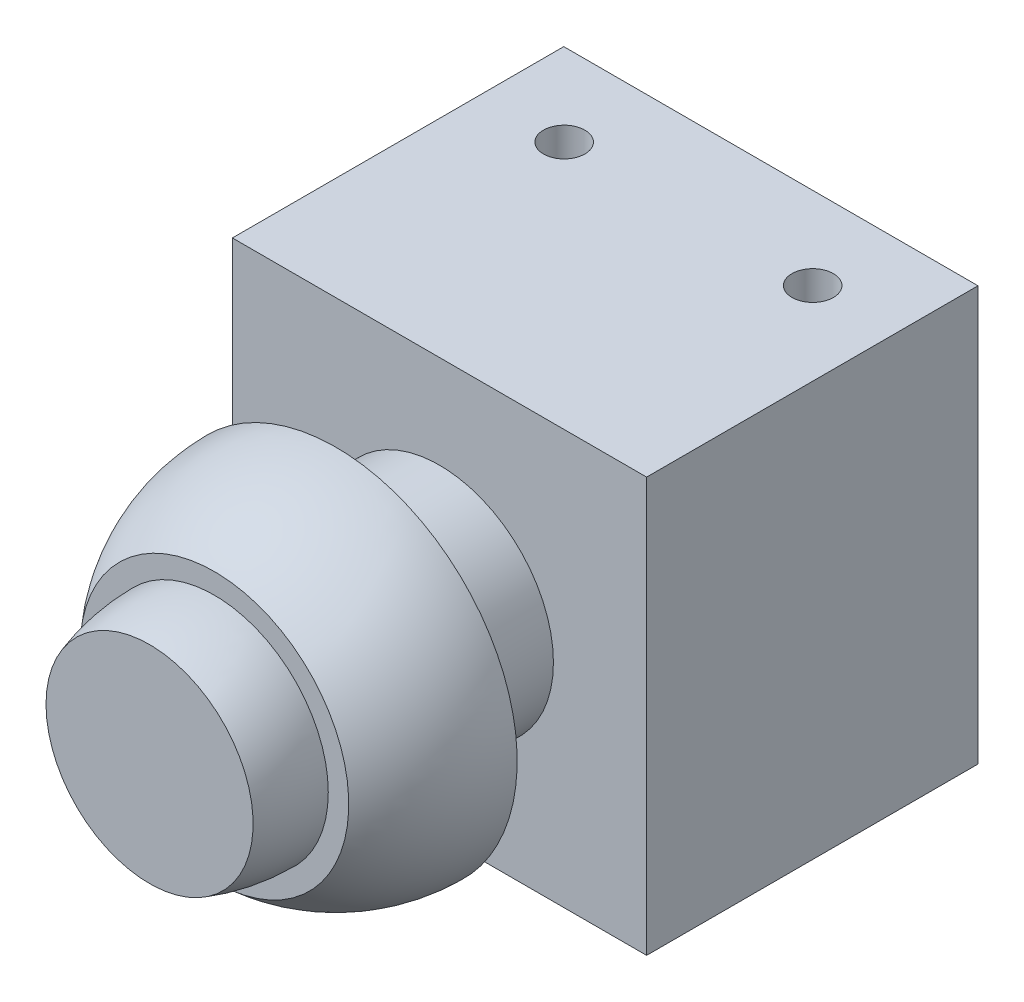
ISO-10303-21;
HEADER;
FILE_DESCRIPTION(('STEP AP214'),'2;1');
FILE_NAME('part.step','',(''),(''),'','','');
FILE_SCHEMA(('AUTOMOTIVE_DESIGN { 1 0 10303 214 1 1 1 1 }'));
ENDSEC;
DATA;
#1=APPLICATION_CONTEXT('core data for automotive mechanical design processes');
#2=APPLICATION_PROTOCOL_DEFINITION('international standard','automotive_design',2000,#1);
#3=PRODUCT_CONTEXT('',#1,'mechanical');
#4=PRODUCT('Part','Part','',(#3));
#5=PRODUCT_RELATED_PRODUCT_CATEGORY('part','',(#4));
#6=PRODUCT_DEFINITION_FORMATION('','',#4);
#7=PRODUCT_DEFINITION_CONTEXT('part definition',#1,'design');
#8=PRODUCT_DEFINITION('design','',#6,#7);
#9=PRODUCT_DEFINITION_SHAPE('','',#8);
#10=(LENGTH_UNIT() NAMED_UNIT(*) SI_UNIT(.MILLI.,.METRE.));
#11=(NAMED_UNIT(*) PLANE_ANGLE_UNIT() SI_UNIT($,.RADIAN.));
#12=(NAMED_UNIT(*) SI_UNIT($,.STERADIAN.) SOLID_ANGLE_UNIT());
#13=UNCERTAINTY_MEASURE_WITH_UNIT(LENGTH_MEASURE(1.E-05),#10,'distance_accuracy_value','');
#14=(GEOMETRIC_REPRESENTATION_CONTEXT(3) GLOBAL_UNCERTAINTY_ASSIGNED_CONTEXT((#13)) GLOBAL_UNIT_ASSIGNED_CONTEXT((#10,
#11,#12)) REPRESENTATION_CONTEXT('',''));
#15=CARTESIAN_POINT('',(0.,0.,0.));
#16=DIRECTION('',(0.,0.,1.));
#17=DIRECTION('',(1.,0.,0.));
#18=AXIS2_PLACEMENT_3D('',#15,#16,#17);
#19=CARTESIAN_POINT('',(20.,-20.,56.5685424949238));
#20=DIRECTION('',(0.,-1.,0.));
#21=DIRECTION('',(0.,0.,-1.));
#22=AXIS2_PLACEMENT_3D('',#19,#20,#21);
#23=PLANE('',#22);
#24=CARTESIAN_POINT('',(-12.,-20.,-34.036711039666));
#25=DIRECTION('',(0.,1.,0.));
#26=DIRECTION('',(0.,0.,1.));
#27=AXIS2_PLACEMENT_3D('',#24,#25,#26);
#28=CIRCLE('',#27,2.00000000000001);
#29=CARTESIAN_POINT('',(-12.,-20.,-32.036711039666));
#30=VERTEX_POINT('',#29);
#31=EDGE_CURVE('E350',#30,#30,#28,.T.);
#32=ORIENTED_EDGE('',*,*,#31,.T.);
#33=EDGE_LOOP('',(#32));
#34=FACE_BOUND('',#33,.T.);
#35=DIRECTION('',(1.,0.,0.));
#36=VECTOR('',#35,1.);
#37=CARTESIAN_POINT('',(20.,-20.,-9.99999999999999));
#38=LINE('',#37,#36);
#39=CARTESIAN_POINT('',(-20.,-20.,-9.99999999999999));
#40=VERTEX_POINT('',#39);
#41=CARTESIAN_POINT('',(20.,-20.,-9.99999999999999));
#42=VERTEX_POINT('',#41);
#43=EDGE_CURVE('E59',#40,#42,#38,.T.);
#44=ORIENTED_EDGE('',*,*,#43,.F.);
#45=DIRECTION('',(0.,0.,-1.));
#46=VECTOR('',#45,1.);
#47=CARTESIAN_POINT('',(-20.,-20.,56.5685424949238));
#48=LINE('',#47,#46);
#49=CARTESIAN_POINT('',(-20.,-20.,-42.));
#50=VERTEX_POINT('',#49);
#51=EDGE_CURVE('E88',#40,#50,#48,.T.);
#52=ORIENTED_EDGE('',*,*,#51,.T.);
#53=DIRECTION('',(-1.,0.,0.));
#54=VECTOR('',#53,1.);
#55=CARTESIAN_POINT('',(20.,-20.,-42.));
#56=LINE('',#55,#54);
#57=CARTESIAN_POINT('',(20.,-20.,-42.));
#58=VERTEX_POINT('',#57);
#59=EDGE_CURVE('E92',#58,#50,#56,.T.);
#60=ORIENTED_EDGE('',*,*,#59,.F.);
#61=DIRECTION('',(0.,0.,-1.));
#62=VECTOR('',#61,1.);
#63=CARTESIAN_POINT('',(20.,-20.,56.5685424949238));
#64=LINE('',#63,#62);
#65=EDGE_CURVE('E79',#42,#58,#64,.T.);
#66=ORIENTED_EDGE('',*,*,#65,.F.);
#67=EDGE_LOOP('',(#44,#52,#60,#66));
#68=FACE_BOUND('',#67,.T.);
#69=CARTESIAN_POINT('',(12.,-20.,-34.036711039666));
#70=DIRECTION('',(0.,1.,0.));
#71=DIRECTION('',(0.,0.,1.));
#72=AXIS2_PLACEMENT_3D('',#69,#70,#71);
#73=CIRCLE('',#72,2.00000000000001);
#74=CARTESIAN_POINT('',(12.,-20.,-32.036711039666));
#75=VERTEX_POINT('',#74);
#76=EDGE_CURVE('E351',#75,#75,#73,.T.);
#77=ORIENTED_EDGE('',*,*,#76,.T.);
#78=EDGE_LOOP('',(#77));
#79=FACE_BOUND('',#78,.T.);
#80=ADVANCED_FACE('F41',(#34,#68,#79),#23,.T.);
#81=CARTESIAN_POINT('',(0.,0.,0.));
#82=DIRECTION('',(0.,0.,-1.));
#83=DIRECTION('',(-1.,0.,0.));
#84=AXIS2_PLACEMENT_3D('',#81,#82,#83);
#85=CYLINDRICAL_SURFACE('',#84,11.);
#86=CARTESIAN_POINT('',(0.,0.,0.));
#87=DIRECTION('',(0.,0.,-1.));
#88=DIRECTION('',(-1.,0.,0.));
#89=AXIS2_PLACEMENT_3D('',#86,#87,#88);
#90=CIRCLE('',#89,11.);
#91=CARTESIAN_POINT('',(-11.,0.,0.));
#92=VERTEX_POINT('',#91);
#93=EDGE_CURVE('E13',#92,#92,#90,.T.);
#94=ORIENTED_EDGE('',*,*,#93,.T.);
#95=EDGE_LOOP('',(#94));
#96=FACE_BOUND('',#95,.T.);
#97=CARTESIAN_POINT('',(0.,0.,-10.));
#98=DIRECTION('',(0.,0.,-1.));
#99=DIRECTION('',(-1.,0.,0.));
#100=AXIS2_PLACEMENT_3D('',#97,#98,#99);
#101=CIRCLE('',#100,11.);
#102=CARTESIAN_POINT('',(-11.,0.,-10.));
#103=VERTEX_POINT('',#102);
#104=EDGE_CURVE('E45',#103,#103,#101,.F.);
#105=ORIENTED_EDGE('',*,*,#104,.T.);
#106=EDGE_LOOP('',(#105));
#107=FACE_BOUND('',#106,.T.);
#108=ADVANCED_FACE('F148',(#96,#107),#85,.T.);
#109=CARTESIAN_POINT('',(0.,10.,18.));
#110=DIRECTION('',(0.,0.,1.));
#111=DIRECTION('',(1.,0.,0.));
#112=AXIS2_PLACEMENT_3D('',#109,#110,#111);
#113=PLANE('',#112);
#114=CARTESIAN_POINT('',(0.,0.,18.));
#115=DIRECTION('',(0.,0.,-1.));
#116=DIRECTION('',(-1.,0.,0.));
#117=AXIS2_PLACEMENT_3D('',#114,#115,#116);
#118=CIRCLE('',#117,9.99999999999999);
#119=CARTESIAN_POINT('',(-9.99999999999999,0.,18.));
#120=VERTEX_POINT('',#119);
#121=EDGE_CURVE('E119',#120,#120,#118,.T.);
#122=ORIENTED_EDGE('',*,*,#121,.F.);
#123=EDGE_LOOP('',(#122));
#124=FACE_BOUND('',#123,.T.);
#125=ADVANCED_FACE('F43',(#124),#113,.T.);
#126=CARTESIAN_POINT('',(0.,11.,0.));
#127=DIRECTION('',(0.,0.,-1.));
#128=DIRECTION('',(-1.,0.,0.));
#129=AXIS2_PLACEMENT_3D('',#126,#127,#128);
#130=PLANE('',#129);
#131=CARTESIAN_POINT('',(0.,0.,0.));
#132=DIRECTION('',(0.,0.,-1.));
#133=DIRECTION('',(-1.,0.,0.));
#134=AXIS2_PLACEMENT_3D('',#131,#132,#133);
#135=CIRCLE('',#134,17.5);
#136=CARTESIAN_POINT('',(-17.5,0.,0.));
#137=VERTEX_POINT('',#136);
#138=EDGE_CURVE('E51',#137,#137,#135,.T.);
#139=ORIENTED_EDGE('',*,*,#138,.T.);
#140=EDGE_LOOP('',(#139));
#141=FACE_BOUND('',#140,.T.);
#142=ORIENTED_EDGE('',*,*,#93,.F.);
#143=EDGE_LOOP('',(#142));
#144=FACE_BOUND('',#143,.T.);
#145=ADVANCED_FACE('F131',(#141,#144),#130,.T.);
#146=CARTESIAN_POINT('',(0.,0.,0.));
#147=DIRECTION('',(0.,0.,-1.));
#148=DIRECTION('',(0.,1.,0.));
#149=AXIS2_PLACEMENT_3D('',#146,#147,#148);
#150=SPHERICAL_SURFACE('',#149,17.5);
#151=CARTESIAN_POINT('',(0.,0.,11.7410754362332));
#152=DIRECTION('',(0.,0.,-1.));
#153=DIRECTION('',(-1.,0.,0.));
#154=AXIS2_PLACEMENT_3D('',#151,#152,#153);
#155=CIRCLE('',#154,12.9767926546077);
#156=CARTESIAN_POINT('',(-12.9767926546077,0.,11.7410754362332));
#157=VERTEX_POINT('',#156);
#158=EDGE_CURVE('E125',#157,#157,#155,.T.);
#159=ORIENTED_EDGE('',*,*,#158,.T.);
#160=EDGE_LOOP('',(#159));
#161=FACE_BOUND('',#160,.T.);
#162=ORIENTED_EDGE('',*,*,#138,.F.);
#163=EDGE_LOOP('',(#162));
#164=FACE_BOUND('',#163,.T.);
#165=ADVANCED_FACE('F134',(#161,#164),#150,.T.);
#166=CARTESIAN_POINT('',(0.,12.9767926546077,11.7410754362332));
#167=DIRECTION('',(0.,0.,1.));
#168=DIRECTION('',(1.,0.,0.));
#169=AXIS2_PLACEMENT_3D('',#166,#167,#168);
#170=PLANE('',#169);
#171=CARTESIAN_POINT('',(0.,0.,11.7410754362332));
#172=DIRECTION('',(0.,0.,-1.));
#173=DIRECTION('',(-1.,0.,0.));
#174=AXIS2_PLACEMENT_3D('',#171,#172,#173);
#175=CIRCLE('',#174,11.);
#176=CARTESIAN_POINT('',(-11.,0.,11.7410754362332));
#177=VERTEX_POINT('',#176);
#178=EDGE_CURVE('E122',#177,#177,#175,.T.);
#179=ORIENTED_EDGE('',*,*,#178,.T.);
#180=EDGE_LOOP('',(#179));
#181=FACE_BOUND('',#180,.T.);
#182=ORIENTED_EDGE('',*,*,#158,.F.);
#183=EDGE_LOOP('',(#182));
#184=FACE_BOUND('',#183,.T.);
#185=ADVANCED_FACE('F136',(#181,#184),#170,.T.);
#186=CARTESIAN_POINT('',(0.,0.,11.7410754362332));
#187=DIRECTION('',(0.,0.,-1.));
#188=DIRECTION('',(-1.,0.,0.));
#189=AXIS2_PLACEMENT_3D('',#186,#187,#188);
#190=DEGENERATE_TOROIDAL_SURFACE('',#189,9.08706834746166,20.0870683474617,.F.);
#191=ORIENTED_EDGE('',*,*,#121,.T.);
#192=EDGE_LOOP('',(#191));
#193=FACE_BOUND('',#192,.T.);
#194=ORIENTED_EDGE('',*,*,#178,.F.);
#195=EDGE_LOOP('',(#194));
#196=FACE_BOUND('',#195,.T.);
#197=ADVANCED_FACE('F143',(#193,#196),#190,.F.);
#198=CARTESIAN_POINT('',(20.,20.,56.5685424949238));
#199=DIRECTION('',(1.,0.,0.));
#200=DIRECTION('',(0.,1.,0.));
#201=AXIS2_PLACEMENT_3D('',#198,#199,#200);
#202=PLANE('',#201);
#203=DIRECTION('',(0.,1.,0.));
#204=VECTOR('',#203,1.);
#205=CARTESIAN_POINT('',(20.,20.,-9.99999999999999));
#206=LINE('',#205,#204);
#207=CARTESIAN_POINT('',(20.,20.,-9.99999999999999));
#208=VERTEX_POINT('',#207);
#209=EDGE_CURVE('E86',#42,#208,#206,.T.);
#210=ORIENTED_EDGE('',*,*,#209,.F.);
#211=ORIENTED_EDGE('',*,*,#65,.T.);
#212=DIRECTION('',(0.,-1.,0.));
#213=VECTOR('',#212,1.);
#214=CARTESIAN_POINT('',(20.,20.,-42.));
#215=LINE('',#214,#213);
#216=CARTESIAN_POINT('',(20.,20.,-42.));
#217=VERTEX_POINT('',#216);
#218=EDGE_CURVE('E84',#217,#58,#215,.T.);
#219=ORIENTED_EDGE('',*,*,#218,.F.);
#220=DIRECTION('',(0.,0.,-1.));
#221=VECTOR('',#220,1.);
#222=CARTESIAN_POINT('',(20.,20.,56.5685424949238));
#223=LINE('',#222,#221);
#224=EDGE_CURVE('E112',#208,#217,#223,.T.);
#225=ORIENTED_EDGE('',*,*,#224,.F.);
#226=EDGE_LOOP('',(#210,#211,#219,#225));
#227=FACE_BOUND('',#226,.T.);
#228=ADVANCED_FACE('F81',(#227),#202,.T.);
#229=CARTESIAN_POINT('',(20.,20.,56.5685424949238));
#230=DIRECTION('',(0.,1.,0.));
#231=DIRECTION('',(0.,0.,1.));
#232=AXIS2_PLACEMENT_3D('',#229,#230,#231);
#233=PLANE('',#232);
#234=CARTESIAN_POINT('',(12.,20.,-34.036711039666));
#235=DIRECTION('',(0.,1.,0.));
#236=DIRECTION('',(0.,0.,1.));
#237=AXIS2_PLACEMENT_3D('',#234,#235,#236);
#238=CIRCLE('',#237,2.00000000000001);
#239=CARTESIAN_POINT('',(12.,20.,-32.036711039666));
#240=VERTEX_POINT('',#239);
#241=EDGE_CURVE('E359',#240,#240,#238,.T.);
#242=ORIENTED_EDGE('',*,*,#241,.F.);
#243=EDGE_LOOP('',(#242));
#244=FACE_BOUND('',#243,.T.);
#245=CARTESIAN_POINT('',(-12.,20.,-34.036711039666));
#246=DIRECTION('',(0.,1.,0.));
#247=DIRECTION('',(0.,0.,1.));
#248=AXIS2_PLACEMENT_3D('',#245,#246,#247);
#249=CIRCLE('',#248,2.00000000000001);
#250=CARTESIAN_POINT('',(-12.,20.,-32.036711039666));
#251=VERTEX_POINT('',#250);
#252=EDGE_CURVE('E105',#251,#251,#249,.T.);
#253=ORIENTED_EDGE('',*,*,#252,.F.);
#254=EDGE_LOOP('',(#253));
#255=FACE_BOUND('',#254,.T.);
#256=DIRECTION('',(-1.,0.,0.));
#257=VECTOR('',#256,1.);
#258=CARTESIAN_POINT('',(20.,20.,-9.99999999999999));
#259=LINE('',#258,#257);
#260=CARTESIAN_POINT('',(-20.,20.,-9.99999999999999));
#261=VERTEX_POINT('',#260);
#262=EDGE_CURVE('E368',#208,#261,#259,.T.);
#263=ORIENTED_EDGE('',*,*,#262,.F.);
#264=ORIENTED_EDGE('',*,*,#224,.T.);
#265=DIRECTION('',(1.,0.,0.));
#266=VECTOR('',#265,1.);
#267=CARTESIAN_POINT('',(20.,20.,-42.));
#268=LINE('',#267,#266);
#269=CARTESIAN_POINT('',(-20.,20.,-42.));
#270=VERTEX_POINT('',#269);
#271=EDGE_CURVE('E89',#270,#217,#268,.T.);
#272=ORIENTED_EDGE('',*,*,#271,.F.);
#273=DIRECTION('',(0.,0.,-1.));
#274=VECTOR('',#273,1.);
#275=CARTESIAN_POINT('',(-20.,20.,56.5685424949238));
#276=LINE('',#275,#274);
#277=EDGE_CURVE('E115',#261,#270,#276,.T.);
#278=ORIENTED_EDGE('',*,*,#277,.F.);
#279=EDGE_LOOP('',(#263,#264,#272,#278));
#280=FACE_BOUND('',#279,.T.);
#281=ADVANCED_FACE('F163',(#244,#255,#280),#233,.T.);
#282=CARTESIAN_POINT('',(-20.,20.,56.5685424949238));
#283=DIRECTION('',(-1.,0.,0.));
#284=DIRECTION('',(0.,0.,1.));
#285=AXIS2_PLACEMENT_3D('',#282,#283,#284);
#286=PLANE('',#285);
#287=DIRECTION('',(0.,-1.,0.));
#288=VECTOR('',#287,1.);
#289=CARTESIAN_POINT('',(-20.,20.,-9.99999999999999));
#290=LINE('',#289,#288);
#291=EDGE_CURVE('E114',#261,#40,#290,.T.);
#292=ORIENTED_EDGE('',*,*,#291,.F.);
#293=ORIENTED_EDGE('',*,*,#277,.T.);
#294=DIRECTION('',(0.,1.,0.));
#295=VECTOR('',#294,1.);
#296=CARTESIAN_POINT('',(-20.,20.,-42.));
#297=LINE('',#296,#295);
#298=EDGE_CURVE('E98',#50,#270,#297,.T.);
#299=ORIENTED_EDGE('',*,*,#298,.F.);
#300=ORIENTED_EDGE('',*,*,#51,.F.);
#301=EDGE_LOOP('',(#292,#293,#299,#300));
#302=FACE_BOUND('',#301,.T.);
#303=ADVANCED_FACE('F159',(#302),#286,.T.);
#304=CARTESIAN_POINT('',(0.,11.,-10.));
#305=DIRECTION('',(0.,0.,-1.));
#306=DIRECTION('',(-1.,0.,0.));
#307=AXIS2_PLACEMENT_3D('',#304,#305,#306);
#308=PLANE('',#307);
#309=ORIENTED_EDGE('',*,*,#104,.F.);
#310=EDGE_LOOP('',(#309));
#311=FACE_BOUND('',#310,.T.);
#312=ORIENTED_EDGE('',*,*,#209,.T.);
#313=ORIENTED_EDGE('',*,*,#262,.T.);
#314=ORIENTED_EDGE('',*,*,#291,.T.);
#315=ORIENTED_EDGE('',*,*,#43,.T.);
#316=EDGE_LOOP('',(#312,#313,#314,#315));
#317=FACE_BOUND('',#316,.T.);
#318=ADVANCED_FACE('F238',(#311,#317),#308,.F.);
#319=CARTESIAN_POINT('',(0.,11.,-42.));
#320=DIRECTION('',(0.,0.,1.));
#321=DIRECTION('',(1.,0.,0.));
#322=AXIS2_PLACEMENT_3D('',#319,#320,#321);
#323=PLANE('',#322);
#324=ORIENTED_EDGE('',*,*,#218,.T.);
#325=ORIENTED_EDGE('',*,*,#59,.T.);
#326=ORIENTED_EDGE('',*,*,#298,.T.);
#327=ORIENTED_EDGE('',*,*,#271,.T.);
#328=EDGE_LOOP('',(#324,#325,#326,#327));
#329=FACE_BOUND('',#328,.T.);
#330=ADVANCED_FACE('F100',(#329),#323,.F.);
#331=CARTESIAN_POINT('',(-12.,15.,-34.036711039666));
#332=DIRECTION('',(0.,1.,0.));
#333=DIRECTION('',(0.,0.,1.));
#334=AXIS2_PLACEMENT_3D('',#331,#332,#333);
#335=CYLINDRICAL_SURFACE('',#334,2.00000000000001);
#336=CARTESIAN_POINT('',(-12.,15.,-34.036711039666));
#337=DIRECTION('',(0.,1.,0.));
#338=DIRECTION('',(0.,0.,1.));
#339=AXIS2_PLACEMENT_3D('',#336,#337,#338);
#340=CIRCLE('',#339,2.00000000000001);
#341=CARTESIAN_POINT('',(-12.,15.,-32.036711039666));
#342=VERTEX_POINT('',#341);
#343=EDGE_CURVE('E102',#342,#342,#340,.T.);
#344=ORIENTED_EDGE('',*,*,#343,.F.);
#345=EDGE_LOOP('',(#344));
#346=FACE_BOUND('',#345,.T.);
#347=ORIENTED_EDGE('',*,*,#252,.T.);
#348=EDGE_LOOP('',(#347));
#349=FACE_BOUND('',#348,.T.);
#350=ADVANCED_FACE('F254',(#346,#349),#335,.F.);
#351=CARTESIAN_POINT('',(-12.,15.,-34.036711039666));
#352=DIRECTION('',(0.,1.,0.));
#353=DIRECTION('',(0.,0.,1.));
#354=AXIS2_PLACEMENT_3D('',#351,#352,#353);
#355=PLANE('',#354);
#356=ORIENTED_EDGE('',*,*,#343,.T.);
#357=EDGE_LOOP('',(#356));
#358=FACE_BOUND('',#357,.T.);
#359=ADVANCED_FACE('F263',(#358),#355,.T.);
#360=CARTESIAN_POINT('',(12.,15.,-34.036711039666));
#361=DIRECTION('',(0.,1.,0.));
#362=DIRECTION('',(0.,0.,1.));
#363=AXIS2_PLACEMENT_3D('',#360,#361,#362);
#364=CYLINDRICAL_SURFACE('',#363,2.00000000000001);
#365=CARTESIAN_POINT('',(12.,15.,-34.036711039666));
#366=DIRECTION('',(0.,1.,0.));
#367=DIRECTION('',(0.,0.,1.));
#368=AXIS2_PLACEMENT_3D('',#365,#366,#367);
#369=CIRCLE('',#368,2.00000000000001);
#370=CARTESIAN_POINT('',(12.,15.,-32.036711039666));
#371=VERTEX_POINT('',#370);
#372=EDGE_CURVE('E361',#371,#371,#369,.T.);
#373=ORIENTED_EDGE('',*,*,#372,.F.);
#374=EDGE_LOOP('',(#373));
#375=FACE_BOUND('',#374,.T.);
#376=ORIENTED_EDGE('',*,*,#241,.T.);
#377=EDGE_LOOP('',(#376));
#378=FACE_BOUND('',#377,.T.);
#379=ADVANCED_FACE('F272',(#375,#378),#364,.F.);
#380=CARTESIAN_POINT('',(12.,15.,-34.036711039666));
#381=DIRECTION('',(0.,1.,0.));
#382=DIRECTION('',(0.,0.,1.));
#383=AXIS2_PLACEMENT_3D('',#380,#381,#382);
#384=PLANE('',#383);
#385=ORIENTED_EDGE('',*,*,#372,.T.);
#386=EDGE_LOOP('',(#385));
#387=FACE_BOUND('',#386,.T.);
#388=ADVANCED_FACE('F281',(#387),#384,.T.);
#389=CARTESIAN_POINT('',(-12.,-15.,-34.036711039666));
#390=DIRECTION('',(0.,-1.,0.));
#391=DIRECTION('',(0.,0.,-1.));
#392=AXIS2_PLACEMENT_3D('',#389,#390,#391);
#393=CYLINDRICAL_SURFACE('',#392,2.00000000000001);
#394=CARTESIAN_POINT('',(-12.,-15.,-34.036711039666));
#395=DIRECTION('',(0.,1.,0.));
#396=DIRECTION('',(0.,0.,1.));
#397=AXIS2_PLACEMENT_3D('',#394,#395,#396);
#398=CIRCLE('',#397,2.00000000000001);
#399=CARTESIAN_POINT('',(-12.,-15.,-32.036711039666));
#400=VERTEX_POINT('',#399);
#401=EDGE_CURVE('E353',#400,#400,#398,.T.);
#402=ORIENTED_EDGE('',*,*,#401,.T.);
#403=EDGE_LOOP('',(#402));
#404=FACE_BOUND('',#403,.T.);
#405=ORIENTED_EDGE('',*,*,#31,.F.);
#406=EDGE_LOOP('',(#405));
#407=FACE_BOUND('',#406,.T.);
#408=ADVANCED_FACE('F290',(#404,#407),#393,.F.);
#409=CARTESIAN_POINT('',(-12.,-15.,-34.036711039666));
#410=DIRECTION('',(0.,-1.,0.));
#411=DIRECTION('',(0.,0.,1.));
#412=AXIS2_PLACEMENT_3D('',#409,#410,#411);
#413=PLANE('',#412);
#414=ORIENTED_EDGE('',*,*,#401,.F.);
#415=EDGE_LOOP('',(#414));
#416=FACE_BOUND('',#415,.T.);
#417=ADVANCED_FACE('F303',(#416),#413,.T.);
#418=CARTESIAN_POINT('',(12.,-15.,-34.036711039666));
#419=DIRECTION('',(0.,-1.,0.));
#420=DIRECTION('',(0.,0.,-1.));
#421=AXIS2_PLACEMENT_3D('',#418,#419,#420);
#422=CYLINDRICAL_SURFACE('',#421,2.00000000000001);
#423=CARTESIAN_POINT('',(12.,-15.,-34.036711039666));
#424=DIRECTION('',(0.,1.,0.));
#425=DIRECTION('',(0.,0.,1.));
#426=AXIS2_PLACEMENT_3D('',#423,#424,#425);
#427=CIRCLE('',#426,2.00000000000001);
#428=CARTESIAN_POINT('',(12.,-15.,-32.036711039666));
#429=VERTEX_POINT('',#428);
#430=EDGE_CURVE('E349',#429,#429,#427,.T.);
#431=ORIENTED_EDGE('',*,*,#430,.T.);
#432=EDGE_LOOP('',(#431));
#433=FACE_BOUND('',#432,.T.);
#434=ORIENTED_EDGE('',*,*,#76,.F.);
#435=EDGE_LOOP('',(#434));
#436=FACE_BOUND('',#435,.T.);
#437=ADVANCED_FACE('F312',(#433,#436),#422,.F.);
#438=CARTESIAN_POINT('',(12.,-15.,-34.036711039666));
#439=DIRECTION('',(0.,-1.,0.));
#440=DIRECTION('',(0.,0.,1.));
#441=AXIS2_PLACEMENT_3D('',#438,#439,#440);
#442=PLANE('',#441);
#443=ORIENTED_EDGE('',*,*,#430,.F.);
#444=EDGE_LOOP('',(#443));
#445=FACE_BOUND('',#444,.T.);
#446=ADVANCED_FACE('F321',(#445),#442,.T.);
#447=CLOSED_SHELL('',(#80,#108,#125,#145,#165,#185,#197,#228,#281,#303,#318,#330,#350,#359,#379,
#388,#408,#417,#437,#446));
#448=MANIFOLD_SOLID_BREP('B2',#447);
#449=ADVANCED_BREP_SHAPE_REPRESENTATION('',(#18,#448),#14);
#450=SHAPE_DEFINITION_REPRESENTATION(#9,#449);
ENDSEC;
END-ISO-10303-21;
